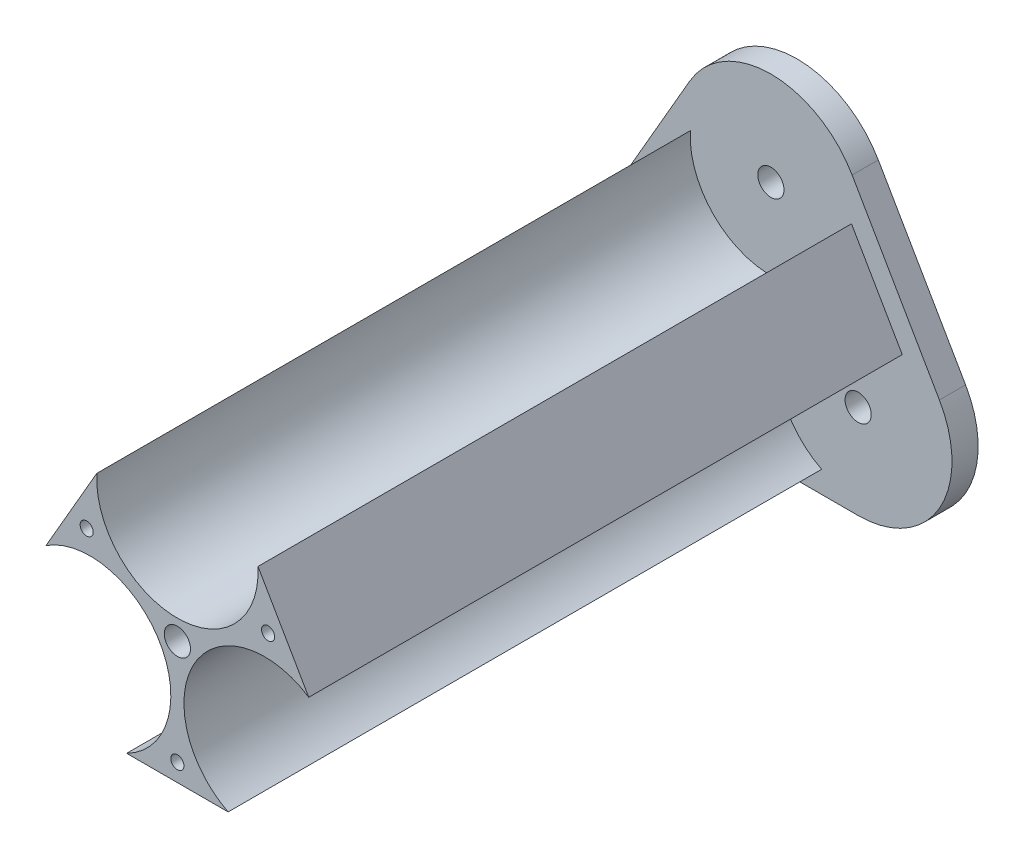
ISO-10303-21;
HEADER;
FILE_DESCRIPTION(('STEP AP214'),'2;1');
FILE_NAME('part.step','',(''),(''),'','','');
FILE_SCHEMA(('AUTOMOTIVE_DESIGN { 1 0 10303 214 1 1 1 1 }'));
ENDSEC;
DATA;
#1=APPLICATION_CONTEXT('core data for automotive mechanical design processes');
#2=APPLICATION_PROTOCOL_DEFINITION('international standard','automotive_design',2000,#1);
#3=PRODUCT_CONTEXT('',#1,'mechanical');
#4=PRODUCT('Part','Part','',(#3));
#5=PRODUCT_RELATED_PRODUCT_CATEGORY('part','',(#4));
#6=PRODUCT_DEFINITION_FORMATION('','',#4);
#7=PRODUCT_DEFINITION_CONTEXT('part definition',#1,'design');
#8=PRODUCT_DEFINITION('design','',#6,#7);
#9=PRODUCT_DEFINITION_SHAPE('','',#8);
#10=(LENGTH_UNIT() NAMED_UNIT(*) SI_UNIT(.MILLI.,.METRE.));
#11=(NAMED_UNIT(*) PLANE_ANGLE_UNIT() SI_UNIT($,.RADIAN.));
#12=(NAMED_UNIT(*) SI_UNIT($,.STERADIAN.) SOLID_ANGLE_UNIT());
#13=UNCERTAINTY_MEASURE_WITH_UNIT(LENGTH_MEASURE(1.E-05),#10,'distance_accuracy_value','');
#14=(GEOMETRIC_REPRESENTATION_CONTEXT(3) GLOBAL_UNCERTAINTY_ASSIGNED_CONTEXT((#13)) GLOBAL_UNIT_ASSIGNED_CONTEXT((#10,
#11,#12)) REPRESENTATION_CONTEXT('',''));
#15=CARTESIAN_POINT('',(0.,0.,0.));
#16=DIRECTION('',(0.,0.,1.));
#17=DIRECTION('',(1.,0.,0.));
#18=AXIS2_PLACEMENT_3D('',#15,#16,#17);
#19=CARTESIAN_POINT('',(-10.,10.75,3.));
#20=DIRECTION('',(0.,0.,-1.));
#21=DIRECTION('',(-1.,0.,0.));
#22=AXIS2_PLACEMENT_3D('',#19,#20,#21);
#23=CYLINDRICAL_SURFACE('',#22,10.75);
#24=CARTESIAN_POINT('',(-10.,10.75,0.));
#25=DIRECTION('',(0.,0.,1.));
#26=DIRECTION('',(-1.,0.,0.));
#27=AXIS2_PLACEMENT_3D('',#24,#25,#26);
#28=CIRCLE('',#27,10.75);
#29=CARTESIAN_POINT('',(-19.3097730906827,16.125,0.));
#30=VERTEX_POINT('',#29);
#31=CARTESIAN_POINT('',(-10.,0.,0.));
#32=VERTEX_POINT('',#31);
#33=EDGE_CURVE('E145',#30,#32,#28,.T.);
#34=ORIENTED_EDGE('',*,*,#33,.T.);
#35=DIRECTION('',(0.,0.,-1.));
#36=VECTOR('',#35,1.);
#37=CARTESIAN_POINT('',(-10.,0.,3.));
#38=LINE('',#37,#36);
#39=CARTESIAN_POINT('',(-10.,0.,3.));
#40=VERTEX_POINT('',#39);
#41=EDGE_CURVE('E11',#40,#32,#38,.T.);
#42=ORIENTED_EDGE('',*,*,#41,.F.);
#43=CARTESIAN_POINT('',(-10.,10.75,3.));
#44=DIRECTION('',(0.,0.,1.));
#45=DIRECTION('',(-1.,0.,0.));
#46=AXIS2_PLACEMENT_3D('',#43,#44,#45);
#47=CIRCLE('',#46,10.75);
#48=CARTESIAN_POINT('',(-19.3097730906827,16.125,3.));
#49=VERTEX_POINT('',#48);
#50=EDGE_CURVE('E154',#49,#40,#47,.T.);
#51=ORIENTED_EDGE('',*,*,#50,.F.);
#52=DIRECTION('',(0.,0.,-1.));
#53=VECTOR('',#52,1.);
#54=CARTESIAN_POINT('',(-19.3097730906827,16.125,3.));
#55=LINE('',#54,#53);
#56=EDGE_CURVE('E167',#49,#30,#55,.T.);
#57=ORIENTED_EDGE('',*,*,#56,.T.);
#58=EDGE_LOOP('',(#34,#42,#51,#57));
#59=FACE_BOUND('',#58,.T.);
#60=ADVANCED_FACE('F35',(#59),#23,.T.);
#61=CARTESIAN_POINT('',(-10.,0.,3.));
#62=DIRECTION('',(0.,1.,0.));
#63=DIRECTION('',(0.,0.,1.));
#64=AXIS2_PLACEMENT_3D('',#61,#62,#63);
#65=PLANE('',#64);
#66=DIRECTION('',(1.,0.,0.));
#67=VECTOR('',#66,1.);
#68=CARTESIAN_POINT('',(-10.,0.,0.));
#69=LINE('',#68,#67);
#70=CARTESIAN_POINT('',(10.,0.,0.));
#71=VERTEX_POINT('',#70);
#72=EDGE_CURVE('E148',#32,#71,#69,.T.);
#73=ORIENTED_EDGE('',*,*,#72,.T.);
#74=DIRECTION('',(0.,0.,-1.));
#75=VECTOR('',#74,1.);
#76=CARTESIAN_POINT('',(10.,0.,3.));
#77=LINE('',#76,#75);
#78=CARTESIAN_POINT('',(10.,0.,3.));
#79=VERTEX_POINT('',#78);
#80=EDGE_CURVE('E42',#79,#71,#77,.T.);
#81=ORIENTED_EDGE('',*,*,#80,.F.);
#82=DIRECTION('',(1.,0.,0.));
#83=VECTOR('',#82,1.);
#84=CARTESIAN_POINT('',(-10.,0.,3.));
#85=LINE('',#84,#83);
#86=EDGE_CURVE('E157',#40,#79,#85,.T.);
#87=ORIENTED_EDGE('',*,*,#86,.F.);
#88=ORIENTED_EDGE('',*,*,#41,.T.);
#89=EDGE_LOOP('',(#73,#81,#87,#88));
#90=FACE_BOUND('',#89,.T.);
#91=ADVANCED_FACE('F215',(#90),#65,.F.);
#92=CARTESIAN_POINT('',(10.,10.75,3.));
#93=DIRECTION('',(0.,0.,-1.));
#94=DIRECTION('',(-1.,0.,0.));
#95=AXIS2_PLACEMENT_3D('',#92,#93,#94);
#96=CYLINDRICAL_SURFACE('',#95,10.75);
#97=CARTESIAN_POINT('',(10.,10.75,0.));
#98=DIRECTION('',(0.,0.,1.));
#99=DIRECTION('',(1.,0.,0.));
#100=AXIS2_PLACEMENT_3D('',#97,#98,#99);
#101=CIRCLE('',#100,10.75);
#102=CARTESIAN_POINT('',(19.3097730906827,16.125,0.));
#103=VERTEX_POINT('',#102);
#104=EDGE_CURVE('E170',#71,#103,#101,.T.);
#105=ORIENTED_EDGE('',*,*,#104,.T.);
#106=DIRECTION('',(0.,0.,-1.));
#107=VECTOR('',#106,1.);
#108=CARTESIAN_POINT('',(19.3097730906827,16.125,3.));
#109=LINE('',#108,#107);
#110=CARTESIAN_POINT('',(19.3097730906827,16.125,3.));
#111=VERTEX_POINT('',#110);
#112=EDGE_CURVE('E185',#111,#103,#109,.T.);
#113=ORIENTED_EDGE('',*,*,#112,.F.);
#114=CARTESIAN_POINT('',(10.,10.75,3.));
#115=DIRECTION('',(0.,0.,1.));
#116=DIRECTION('',(1.,0.,0.));
#117=AXIS2_PLACEMENT_3D('',#114,#115,#116);
#118=CIRCLE('',#117,10.75);
#119=EDGE_CURVE('E160',#79,#111,#118,.T.);
#120=ORIENTED_EDGE('',*,*,#119,.F.);
#121=ORIENTED_EDGE('',*,*,#80,.T.);
#122=EDGE_LOOP('',(#105,#113,#120,#121));
#123=FACE_BOUND('',#122,.T.);
#124=ADVANCED_FACE('F192',(#123),#96,.T.);
#125=CARTESIAN_POINT('',(9.30977309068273,33.4455080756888,3.));
#126=DIRECTION('',(-0.866025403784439,-0.5,0.));
#127=DIRECTION('',(0.5,-0.866025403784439,0.));
#128=AXIS2_PLACEMENT_3D('',#125,#126,#127);
#129=PLANE('',#128);
#130=DIRECTION('',(-0.499999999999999,0.866025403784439,0.));
#131=VECTOR('',#130,1.);
#132=CARTESIAN_POINT('',(9.30977309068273,33.4455080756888,0.));
#133=LINE('',#132,#131);
#134=CARTESIAN_POINT('',(9.30977309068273,33.4455080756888,0.));
#135=VERTEX_POINT('',#134);
#136=EDGE_CURVE('E172',#103,#135,#133,.T.);
#137=ORIENTED_EDGE('',*,*,#136,.T.);
#138=DIRECTION('',(0.,0.,-1.));
#139=VECTOR('',#138,1.);
#140=CARTESIAN_POINT('',(9.30977309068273,33.4455080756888,3.));
#141=LINE('',#140,#139);
#142=CARTESIAN_POINT('',(9.30977309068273,33.4455080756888,3.));
#143=VERTEX_POINT('',#142);
#144=EDGE_CURVE('E182',#143,#135,#141,.T.);
#145=ORIENTED_EDGE('',*,*,#144,.F.);
#146=DIRECTION('',(-0.499999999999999,0.866025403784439,0.));
#147=VECTOR('',#146,1.);
#148=CARTESIAN_POINT('',(9.30977309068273,33.4455080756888,3.));
#149=LINE('',#148,#147);
#150=EDGE_CURVE('E162',#111,#143,#149,.T.);
#151=ORIENTED_EDGE('',*,*,#150,.F.);
#152=ORIENTED_EDGE('',*,*,#112,.T.);
#153=EDGE_LOOP('',(#137,#145,#151,#152));
#154=FACE_BOUND('',#153,.T.);
#155=ADVANCED_FACE('F203',(#154),#129,.F.);
#156=CARTESIAN_POINT('',(0.,28.0705080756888,3.));
#157=DIRECTION('',(0.,0.,-1.));
#158=DIRECTION('',(-1.,0.,0.));
#159=AXIS2_PLACEMENT_3D('',#156,#157,#158);
#160=CYLINDRICAL_SURFACE('',#159,10.75);
#161=CARTESIAN_POINT('',(0.,28.0705080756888,0.));
#162=DIRECTION('',(0.,0.,1.));
#163=DIRECTION('',(-1.,0.,0.));
#164=AXIS2_PLACEMENT_3D('',#161,#162,#163);
#165=CIRCLE('',#164,10.75);
#166=CARTESIAN_POINT('',(-9.30977309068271,33.4455080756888,0.));
#167=VERTEX_POINT('',#166);
#168=EDGE_CURVE('E174',#135,#167,#165,.T.);
#169=ORIENTED_EDGE('',*,*,#168,.T.);
#170=DIRECTION('',(0.,0.,-1.));
#171=VECTOR('',#170,1.);
#172=CARTESIAN_POINT('',(-9.30977309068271,33.4455080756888,3.));
#173=LINE('',#172,#171);
#174=CARTESIAN_POINT('',(-9.30977309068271,33.4455080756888,3.));
#175=VERTEX_POINT('',#174);
#176=EDGE_CURVE('E179',#175,#167,#173,.T.);
#177=ORIENTED_EDGE('',*,*,#176,.F.);
#178=CARTESIAN_POINT('',(0.,28.0705080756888,3.));
#179=DIRECTION('',(0.,0.,1.));
#180=DIRECTION('',(-1.,0.,0.));
#181=AXIS2_PLACEMENT_3D('',#178,#179,#180);
#182=CIRCLE('',#181,10.75);
#183=EDGE_CURVE('E164',#143,#175,#182,.T.);
#184=ORIENTED_EDGE('',*,*,#183,.F.);
#185=ORIENTED_EDGE('',*,*,#144,.T.);
#186=EDGE_LOOP('',(#169,#177,#184,#185));
#187=FACE_BOUND('',#186,.T.);
#188=ADVANCED_FACE('F207',(#187),#160,.T.);
#189=CARTESIAN_POINT('',(-9.30977309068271,33.4455080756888,3.));
#190=DIRECTION('',(0.866025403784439,-0.5,0.));
#191=DIRECTION('',(0.5,0.866025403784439,0.));
#192=AXIS2_PLACEMENT_3D('',#189,#190,#191);
#193=PLANE('',#192);
#194=DIRECTION('',(-0.5,-0.866025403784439,0.));
#195=VECTOR('',#194,1.);
#196=CARTESIAN_POINT('',(-9.30977309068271,33.4455080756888,0.));
#197=LINE('',#196,#195);
#198=EDGE_CURVE('E158',#167,#30,#197,.T.);
#199=ORIENTED_EDGE('',*,*,#198,.T.);
#200=ORIENTED_EDGE('',*,*,#56,.F.);
#201=DIRECTION('',(-0.5,-0.866025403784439,0.));
#202=VECTOR('',#201,1.);
#203=CARTESIAN_POINT('',(-9.30977309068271,33.4455080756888,3.));
#204=LINE('',#203,#202);
#205=EDGE_CURVE('E166',#175,#49,#204,.T.);
#206=ORIENTED_EDGE('',*,*,#205,.F.);
#207=ORIENTED_EDGE('',*,*,#176,.T.);
#208=EDGE_LOOP('',(#199,#200,#206,#207));
#209=FACE_BOUND('',#208,.T.);
#210=ADVANCED_FACE('F218',(#209),#193,.F.);
#211=CARTESIAN_POINT('',(-10.,10.75,3.));
#212=DIRECTION('',(0.,0.,-1.));
#213=DIRECTION('',(-1.,0.,0.));
#214=AXIS2_PLACEMENT_3D('',#211,#212,#213);
#215=PLANE('',#214);
#216=CARTESIAN_POINT('',(-10.,10.75,3.));
#217=DIRECTION('',(0.,0.,1.));
#218=DIRECTION('',(1.,0.,0.));
#219=AXIS2_PLACEMENT_3D('',#216,#217,#218);
#220=CIRCLE('',#219,1.5);
#221=CARTESIAN_POINT('',(-8.5,10.75,3.));
#222=VERTEX_POINT('',#221);
#223=EDGE_CURVE('E444',#222,#222,#220,.T.);
#224=ORIENTED_EDGE('',*,*,#223,.F.);
#225=EDGE_LOOP('',(#224));
#226=FACE_BOUND('',#225,.T.);
#227=CARTESIAN_POINT('',(10.,10.75,3.));
#228=DIRECTION('',(0.,0.,1.));
#229=DIRECTION('',(1.,0.,0.));
#230=AXIS2_PLACEMENT_3D('',#227,#228,#229);
#231=CIRCLE('',#230,1.5);
#232=CARTESIAN_POINT('',(11.5,10.75,3.));
#233=VERTEX_POINT('',#232);
#234=EDGE_CURVE('E451',#233,#233,#231,.T.);
#235=ORIENTED_EDGE('',*,*,#234,.F.);
#236=EDGE_LOOP('',(#235));
#237=FACE_BOUND('',#236,.T.);
#238=CARTESIAN_POINT('',(0.,28.0705080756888,3.));
#239=DIRECTION('',(0.,0.,1.));
#240=DIRECTION('',(1.,0.,0.));
#241=AXIS2_PLACEMENT_3D('',#238,#239,#240);
#242=CIRCLE('',#241,1.5);
#243=CARTESIAN_POINT('',(1.50000000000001,28.0705080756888,3.));
#244=VERTEX_POINT('',#243);
#245=EDGE_CURVE('E456',#244,#244,#242,.T.);
#246=ORIENTED_EDGE('',*,*,#245,.F.);
#247=EDGE_LOOP('',(#246));
#248=FACE_BOUND('',#247,.T.);
#249=CARTESIAN_POINT('',(-9.99999999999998,10.75,3.));
#250=DIRECTION('',(0.,0.,-1.));
#251=DIRECTION('',(1.,0.,0.));
#252=AXIS2_PLACEMENT_3D('',#249,#250,#251);
#253=CIRCLE('',#252,9.25);
#254=CARTESIAN_POINT('',(-15.0530595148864,18.4978441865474,3.));
#255=VERTEX_POINT('',#254);
#256=CARTESIAN_POINT('',(-5.81669986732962,2.5,3.));
#257=VERTEX_POINT('',#256);
#258=EDGE_CURVE('E144',#255,#257,#253,.T.);
#259=ORIENTED_EDGE('',*,*,#258,.F.);
#260=DIRECTION('',(-0.5,-0.866025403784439,0.));
#261=VECTOR('',#260,1.);
#262=CARTESIAN_POINT('',(-9.2363596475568,28.5726638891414,3.));
#263=LINE('',#262,#261);
#264=CARTESIAN_POINT('',(-9.23635964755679,28.5726638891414,3.));
#265=VERTEX_POINT('',#264);
#266=EDGE_CURVE('E141',#265,#255,#263,.T.);
#267=ORIENTED_EDGE('',*,*,#266,.F.);
#268=CARTESIAN_POINT('',(0.,28.0705080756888,3.));
#269=DIRECTION('',(0.,0.,-1.));
#270=DIRECTION('',(1.,0.,0.));
#271=AXIS2_PLACEMENT_3D('',#268,#269,#270);
#272=CIRCLE('',#271,9.25);
#273=CARTESIAN_POINT('',(9.23635964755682,28.5726638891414,3.));
#274=VERTEX_POINT('',#273);
#275=EDGE_CURVE('E496',#274,#265,#272,.T.);
#276=ORIENTED_EDGE('',*,*,#275,.F.);
#277=DIRECTION('',(-0.5,0.866025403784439,0.));
#278=VECTOR('',#277,1.);
#279=CARTESIAN_POINT('',(9.23635964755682,28.5726638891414,3.));
#280=LINE('',#279,#278);
#281=CARTESIAN_POINT('',(15.0530595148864,18.4978441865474,3.));
#282=VERTEX_POINT('',#281);
#283=EDGE_CURVE('E493',#282,#274,#280,.T.);
#284=ORIENTED_EDGE('',*,*,#283,.F.);
#285=CARTESIAN_POINT('',(10.,10.75,3.));
#286=DIRECTION('',(0.,0.,-1.));
#287=DIRECTION('',(1.,0.,0.));
#288=AXIS2_PLACEMENT_3D('',#285,#286,#287);
#289=CIRCLE('',#288,9.25);
#290=CARTESIAN_POINT('',(5.81669986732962,2.5,3.));
#291=VERTEX_POINT('',#290);
#292=EDGE_CURVE('E54',#291,#282,#289,.T.);
#293=ORIENTED_EDGE('',*,*,#292,.F.);
#294=DIRECTION('',(1.,0.,0.));
#295=VECTOR('',#294,1.);
#296=CARTESIAN_POINT('',(-5.81669986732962,2.5,3.));
#297=LINE('',#296,#295);
#298=EDGE_CURVE('E49',#257,#291,#297,.T.);
#299=ORIENTED_EDGE('',*,*,#298,.F.);
#300=EDGE_LOOP('',(#259,#267,#276,#284,#293,#299));
#301=FACE_BOUND('',#300,.T.);
#302=ORIENTED_EDGE('',*,*,#50,.T.);
#303=ORIENTED_EDGE('',*,*,#86,.T.);
#304=ORIENTED_EDGE('',*,*,#119,.T.);
#305=ORIENTED_EDGE('',*,*,#150,.T.);
#306=ORIENTED_EDGE('',*,*,#183,.T.);
#307=ORIENTED_EDGE('',*,*,#205,.T.);
#308=EDGE_LOOP('',(#302,#303,#304,#305,#306,#307));
#309=FACE_BOUND('',#308,.T.);
#310=ADVANCED_FACE('F211',(#226,#237,#248,#301,#309),#215,.F.);
#311=CARTESIAN_POINT('',(-10.,10.75,0.));
#312=DIRECTION('',(0.,0.,-1.));
#313=DIRECTION('',(-1.,0.,0.));
#314=AXIS2_PLACEMENT_3D('',#311,#312,#313);
#315=PLANE('',#314);
#316=CARTESIAN_POINT('',(0.,16.5235026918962,0.));
#317=DIRECTION('',(0.,0.,1.));
#318=DIRECTION('',(1.,0.,0.));
#319=AXIS2_PLACEMENT_3D('',#316,#317,#318);
#320=CIRCLE('',#319,1.5);
#321=CARTESIAN_POINT('',(1.5,16.5235026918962,0.));
#322=VERTEX_POINT('',#321);
#323=EDGE_CURVE('E443',#322,#322,#320,.T.);
#324=ORIENTED_EDGE('',*,*,#323,.T.);
#325=EDGE_LOOP('',(#324));
#326=FACE_BOUND('',#325,.T.);
#327=CARTESIAN_POINT('',(-10.,10.75,0.));
#328=DIRECTION('',(0.,0.,1.));
#329=DIRECTION('',(1.,0.,0.));
#330=AXIS2_PLACEMENT_3D('',#327,#328,#329);
#331=CIRCLE('',#330,1.5);
#332=CARTESIAN_POINT('',(-8.5,10.75,0.));
#333=VERTEX_POINT('',#332);
#334=EDGE_CURVE('E447',#333,#333,#331,.T.);
#335=ORIENTED_EDGE('',*,*,#334,.T.);
#336=EDGE_LOOP('',(#335));
#337=FACE_BOUND('',#336,.T.);
#338=CARTESIAN_POINT('',(10.,10.75,0.));
#339=DIRECTION('',(0.,0.,1.));
#340=DIRECTION('',(1.,0.,0.));
#341=AXIS2_PLACEMENT_3D('',#338,#339,#340);
#342=CIRCLE('',#341,1.5);
#343=CARTESIAN_POINT('',(11.5,10.75,0.));
#344=VERTEX_POINT('',#343);
#345=EDGE_CURVE('E453',#344,#344,#342,.T.);
#346=ORIENTED_EDGE('',*,*,#345,.T.);
#347=EDGE_LOOP('',(#346));
#348=FACE_BOUND('',#347,.T.);
#349=CARTESIAN_POINT('',(0.,28.0705080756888,0.));
#350=DIRECTION('',(0.,0.,1.));
#351=DIRECTION('',(1.,0.,0.));
#352=AXIS2_PLACEMENT_3D('',#349,#350,#351);
#353=CIRCLE('',#352,1.5);
#354=CARTESIAN_POINT('',(1.50000000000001,28.0705080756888,0.));
#355=VERTEX_POINT('',#354);
#356=EDGE_CURVE('E459',#355,#355,#353,.T.);
#357=ORIENTED_EDGE('',*,*,#356,.T.);
#358=EDGE_LOOP('',(#357));
#359=FACE_BOUND('',#358,.T.);
#360=ORIENTED_EDGE('',*,*,#33,.F.);
#361=ORIENTED_EDGE('',*,*,#198,.F.);
#362=ORIENTED_EDGE('',*,*,#168,.F.);
#363=ORIENTED_EDGE('',*,*,#136,.F.);
#364=ORIENTED_EDGE('',*,*,#104,.F.);
#365=ORIENTED_EDGE('',*,*,#72,.F.);
#366=EDGE_LOOP('',(#360,#361,#362,#363,#364,#365));
#367=FACE_BOUND('',#366,.T.);
#368=ADVANCED_FACE('F198',(#326,#337,#348,#359,#367),#315,.T.);
#369=CARTESIAN_POINT('',(-9.99999999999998,10.75,71.));
#370=DIRECTION('',(0.,0.,1.));
#371=DIRECTION('',(1.,0.,0.));
#372=AXIS2_PLACEMENT_3D('',#369,#370,#371);
#373=PLANE('',#372);
#374=CARTESIAN_POINT('',(-10.3923048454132,22.5235026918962,71.));
#375=DIRECTION('',(0.,0.,1.));
#376=DIRECTION('',(1.,0.,0.));
#377=AXIS2_PLACEMENT_3D('',#374,#375,#376);
#378=CIRCLE('',#377,0.750000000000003);
#379=CARTESIAN_POINT('',(-9.64230484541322,22.5235026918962,71.));
#380=VERTEX_POINT('',#379);
#381=EDGE_CURVE('E462',#380,#380,#378,.T.);
#382=ORIENTED_EDGE('',*,*,#381,.F.);
#383=EDGE_LOOP('',(#382));
#384=FACE_BOUND('',#383,.T.);
#385=CARTESIAN_POINT('',(0.,4.52350269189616,71.));
#386=DIRECTION('',(0.,0.,1.));
#387=DIRECTION('',(1.,0.,0.));
#388=AXIS2_PLACEMENT_3D('',#385,#386,#387);
#389=CIRCLE('',#388,0.75);
#390=CARTESIAN_POINT('',(0.750000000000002,4.52350269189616,71.));
#391=VERTEX_POINT('',#390);
#392=EDGE_CURVE('E468',#391,#391,#389,.T.);
#393=ORIENTED_EDGE('',*,*,#392,.F.);
#394=EDGE_LOOP('',(#393));
#395=FACE_BOUND('',#394,.T.);
#396=CARTESIAN_POINT('',(10.3923048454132,22.5235026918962,71.));
#397=DIRECTION('',(0.,0.,1.));
#398=DIRECTION('',(1.,0.,0.));
#399=AXIS2_PLACEMENT_3D('',#396,#397,#398);
#400=CIRCLE('',#399,0.75);
#401=CARTESIAN_POINT('',(11.1423048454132,22.5235026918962,71.));
#402=VERTEX_POINT('',#401);
#403=EDGE_CURVE('E474',#402,#402,#400,.T.);
#404=ORIENTED_EDGE('',*,*,#403,.F.);
#405=EDGE_LOOP('',(#404));
#406=FACE_BOUND('',#405,.T.);
#407=CARTESIAN_POINT('',(-9.99999999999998,10.75,71.));
#408=DIRECTION('',(0.,0.,-1.));
#409=DIRECTION('',(1.,0.,0.));
#410=AXIS2_PLACEMENT_3D('',#407,#408,#409);
#411=CIRCLE('',#410,9.25);
#412=CARTESIAN_POINT('',(-15.0530595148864,18.4978441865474,71.));
#413=VERTEX_POINT('',#412);
#414=CARTESIAN_POINT('',(-5.81669986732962,2.5,71.));
#415=VERTEX_POINT('',#414);
#416=EDGE_CURVE('E131',#413,#415,#411,.T.);
#417=ORIENTED_EDGE('',*,*,#416,.T.);
#418=DIRECTION('',(1.,0.,0.));
#419=VECTOR('',#418,1.);
#420=CARTESIAN_POINT('',(-5.81669986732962,2.5,71.));
#421=LINE('',#420,#419);
#422=CARTESIAN_POINT('',(5.81669986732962,2.5,71.));
#423=VERTEX_POINT('',#422);
#424=EDGE_CURVE('E120',#415,#423,#421,.T.);
#425=ORIENTED_EDGE('',*,*,#424,.T.);
#426=CARTESIAN_POINT('',(10.,10.75,71.));
#427=DIRECTION('',(0.,0.,-1.));
#428=DIRECTION('',(1.,0.,0.));
#429=AXIS2_PLACEMENT_3D('',#426,#427,#428);
#430=CIRCLE('',#429,9.25);
#431=CARTESIAN_POINT('',(15.0530595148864,18.4978441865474,71.));
#432=VERTEX_POINT('',#431);
#433=EDGE_CURVE('E130',#423,#432,#430,.T.);
#434=ORIENTED_EDGE('',*,*,#433,.T.);
#435=DIRECTION('',(-0.5,0.866025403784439,0.));
#436=VECTOR('',#435,1.);
#437=CARTESIAN_POINT('',(9.23635964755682,28.5726638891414,71.));
#438=LINE('',#437,#436);
#439=CARTESIAN_POINT('',(9.23635964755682,28.5726638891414,71.));
#440=VERTEX_POINT('',#439);
#441=EDGE_CURVE('E484',#432,#440,#438,.T.);
#442=ORIENTED_EDGE('',*,*,#441,.T.);
#443=CARTESIAN_POINT('',(0.,28.0705080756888,71.));
#444=DIRECTION('',(0.,0.,-1.));
#445=DIRECTION('',(1.,0.,0.));
#446=AXIS2_PLACEMENT_3D('',#443,#444,#445);
#447=CIRCLE('',#446,9.25);
#448=CARTESIAN_POINT('',(-9.2363596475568,28.5726638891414,71.));
#449=VERTEX_POINT('',#448);
#450=EDGE_CURVE('E486',#440,#449,#447,.T.);
#451=ORIENTED_EDGE('',*,*,#450,.T.);
#452=DIRECTION('',(-0.5,-0.866025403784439,0.));
#453=VECTOR('',#452,1.);
#454=CARTESIAN_POINT('',(-9.2363596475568,28.5726638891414,71.));
#455=LINE('',#454,#453);
#456=EDGE_CURVE('E137',#449,#413,#455,.T.);
#457=ORIENTED_EDGE('',*,*,#456,.T.);
#458=EDGE_LOOP('',(#417,#425,#434,#442,#451,#457));
#459=FACE_BOUND('',#458,.T.);
#460=CARTESIAN_POINT('',(0.,16.5235026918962,71.));
#461=DIRECTION('',(0.,0.,1.));
#462=DIRECTION('',(1.,0.,0.));
#463=AXIS2_PLACEMENT_3D('',#460,#461,#462);
#464=CIRCLE('',#463,1.5);
#465=CARTESIAN_POINT('',(1.5,16.5235026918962,71.));
#466=VERTEX_POINT('',#465);
#467=EDGE_CURVE('E440',#466,#466,#464,.T.);
#468=ORIENTED_EDGE('',*,*,#467,.F.);
#469=EDGE_LOOP('',(#468));
#470=FACE_BOUND('',#469,.T.);
#471=ADVANCED_FACE('F134',(#384,#395,#406,#459,#470),#373,.T.);
#472=CARTESIAN_POINT('',(-9.99999999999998,10.75,71.));
#473=DIRECTION('',(0.,0.,-1.));
#474=DIRECTION('',(-1.,0.,0.));
#475=AXIS2_PLACEMENT_3D('',#472,#473,#474);
#476=CYLINDRICAL_SURFACE('',#475,9.25);
#477=ORIENTED_EDGE('',*,*,#258,.T.);
#478=DIRECTION('',(0.,0.,-1.));
#479=VECTOR('',#478,1.);
#480=CARTESIAN_POINT('',(-5.81669986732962,2.5,71.));
#481=LINE('',#480,#479);
#482=EDGE_CURVE('E124',#415,#257,#481,.T.);
#483=ORIENTED_EDGE('',*,*,#482,.F.);
#484=ORIENTED_EDGE('',*,*,#416,.F.);
#485=DIRECTION('',(0.,0.,-1.));
#486=VECTOR('',#485,1.);
#487=CARTESIAN_POINT('',(-15.0530595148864,18.4978441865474,71.));
#488=LINE('',#487,#486);
#489=EDGE_CURVE('E489',#413,#255,#488,.T.);
#490=ORIENTED_EDGE('',*,*,#489,.T.);
#491=EDGE_LOOP('',(#477,#483,#484,#490));
#492=FACE_BOUND('',#491,.T.);
#493=ADVANCED_FACE('F143',(#492),#476,.F.);
#494=CARTESIAN_POINT('',(-5.81669986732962,2.5,71.));
#495=DIRECTION('',(0.,1.,0.));
#496=DIRECTION('',(0.,0.,1.));
#497=AXIS2_PLACEMENT_3D('',#494,#495,#496);
#498=PLANE('',#497);
#499=ORIENTED_EDGE('',*,*,#298,.T.);
#500=DIRECTION('',(0.,0.,-1.));
#501=VECTOR('',#500,1.);
#502=CARTESIAN_POINT('',(5.81669986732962,2.5,71.));
#503=LINE('',#502,#501);
#504=EDGE_CURVE('E127',#423,#291,#503,.T.);
#505=ORIENTED_EDGE('',*,*,#504,.F.);
#506=ORIENTED_EDGE('',*,*,#424,.F.);
#507=ORIENTED_EDGE('',*,*,#482,.T.);
#508=EDGE_LOOP('',(#499,#505,#506,#507));
#509=FACE_BOUND('',#508,.T.);
#510=ADVANCED_FACE('F122',(#509),#498,.F.);
#511=CARTESIAN_POINT('',(10.,10.75,71.));
#512=DIRECTION('',(0.,0.,-1.));
#513=DIRECTION('',(-1.,0.,0.));
#514=AXIS2_PLACEMENT_3D('',#511,#512,#513);
#515=CYLINDRICAL_SURFACE('',#514,9.25);
#516=ORIENTED_EDGE('',*,*,#292,.T.);
#517=DIRECTION('',(0.,0.,-1.));
#518=VECTOR('',#517,1.);
#519=CARTESIAN_POINT('',(15.0530595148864,18.4978441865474,71.));
#520=LINE('',#519,#518);
#521=EDGE_CURVE('E150',#432,#282,#520,.T.);
#522=ORIENTED_EDGE('',*,*,#521,.F.);
#523=ORIENTED_EDGE('',*,*,#433,.F.);
#524=ORIENTED_EDGE('',*,*,#504,.T.);
#525=EDGE_LOOP('',(#516,#522,#523,#524));
#526=FACE_BOUND('',#525,.T.);
#527=ADVANCED_FACE('F271',(#526),#515,.F.);
#528=CARTESIAN_POINT('',(9.23635964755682,28.5726638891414,71.));
#529=DIRECTION('',(-0.866025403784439,-0.5,0.));
#530=DIRECTION('',(0.5,-0.866025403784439,0.));
#531=AXIS2_PLACEMENT_3D('',#528,#529,#530);
#532=PLANE('',#531);
#533=ORIENTED_EDGE('',*,*,#283,.T.);
#534=DIRECTION('',(0.,0.,-1.));
#535=VECTOR('',#534,1.);
#536=CARTESIAN_POINT('',(9.23635964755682,28.5726638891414,71.));
#537=LINE('',#536,#535);
#538=EDGE_CURVE('E505',#440,#274,#537,.T.);
#539=ORIENTED_EDGE('',*,*,#538,.F.);
#540=ORIENTED_EDGE('',*,*,#441,.F.);
#541=ORIENTED_EDGE('',*,*,#521,.T.);
#542=EDGE_LOOP('',(#533,#539,#540,#541));
#543=FACE_BOUND('',#542,.T.);
#544=ADVANCED_FACE('F280',(#543),#532,.F.);
#545=CARTESIAN_POINT('',(0.,28.0705080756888,71.));
#546=DIRECTION('',(0.,0.,-1.));
#547=DIRECTION('',(-1.,0.,0.));
#548=AXIS2_PLACEMENT_3D('',#545,#546,#547);
#549=CYLINDRICAL_SURFACE('',#548,9.25);
#550=ORIENTED_EDGE('',*,*,#275,.T.);
#551=DIRECTION('',(0.,0.,-1.));
#552=VECTOR('',#551,1.);
#553=CARTESIAN_POINT('',(-9.2363596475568,28.5726638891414,71.));
#554=LINE('',#553,#552);
#555=EDGE_CURVE('E502',#449,#265,#554,.T.);
#556=ORIENTED_EDGE('',*,*,#555,.F.);
#557=ORIENTED_EDGE('',*,*,#450,.F.);
#558=ORIENTED_EDGE('',*,*,#538,.T.);
#559=EDGE_LOOP('',(#550,#556,#557,#558));
#560=FACE_BOUND('',#559,.T.);
#561=ADVANCED_FACE('F290',(#560),#549,.F.);
#562=CARTESIAN_POINT('',(-9.2363596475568,28.5726638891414,71.));
#563=DIRECTION('',(0.866025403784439,-0.5,0.));
#564=DIRECTION('',(0.5,0.866025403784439,0.));
#565=AXIS2_PLACEMENT_3D('',#562,#563,#564);
#566=PLANE('',#565);
#567=ORIENTED_EDGE('',*,*,#266,.T.);
#568=ORIENTED_EDGE('',*,*,#489,.F.);
#569=ORIENTED_EDGE('',*,*,#456,.F.);
#570=ORIENTED_EDGE('',*,*,#555,.T.);
#571=EDGE_LOOP('',(#567,#568,#569,#570));
#572=FACE_BOUND('',#571,.T.);
#573=ADVANCED_FACE('F300',(#572),#566,.F.);
#574=CARTESIAN_POINT('',(0.,16.5235026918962,71.));
#575=DIRECTION('',(0.,0.,-1.));
#576=DIRECTION('',(-1.,0.,0.));
#577=AXIS2_PLACEMENT_3D('',#574,#575,#576);
#578=CYLINDRICAL_SURFACE('',#577,1.5);
#579=ORIENTED_EDGE('',*,*,#467,.T.);
#580=EDGE_LOOP('',(#579));
#581=FACE_BOUND('',#580,.T.);
#582=ORIENTED_EDGE('',*,*,#323,.F.);
#583=EDGE_LOOP('',(#582));
#584=FACE_BOUND('',#583,.T.);
#585=ADVANCED_FACE('F310',(#581,#584),#578,.F.);
#586=CARTESIAN_POINT('',(10.3923048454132,22.5235026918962,56.));
#587=DIRECTION('',(0.,0.,1.));
#588=DIRECTION('',(1.,0.,0.));
#589=AXIS2_PLACEMENT_3D('',#586,#587,#588);
#590=CYLINDRICAL_SURFACE('',#589,0.75);
#591=CARTESIAN_POINT('',(10.3923048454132,22.5235026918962,56.));
#592=DIRECTION('',(0.,0.,1.));
#593=DIRECTION('',(1.,0.,0.));
#594=AXIS2_PLACEMENT_3D('',#591,#592,#593);
#595=CIRCLE('',#594,0.75);
#596=CARTESIAN_POINT('',(11.1423048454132,22.5235026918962,56.));
#597=VERTEX_POINT('',#596);
#598=EDGE_CURVE('E477',#597,#597,#595,.T.);
#599=ORIENTED_EDGE('',*,*,#598,.F.);
#600=EDGE_LOOP('',(#599));
#601=FACE_BOUND('',#600,.T.);
#602=ORIENTED_EDGE('',*,*,#403,.T.);
#603=EDGE_LOOP('',(#602));
#604=FACE_BOUND('',#603,.T.);
#605=ADVANCED_FACE('F327',(#601,#604),#590,.F.);
#606=CARTESIAN_POINT('',(10.3923048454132,22.5235026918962,56.));
#607=DIRECTION('',(0.,0.,1.));
#608=DIRECTION('',(1.,0.,0.));
#609=AXIS2_PLACEMENT_3D('',#606,#607,#608);
#610=PLANE('',#609);
#611=ORIENTED_EDGE('',*,*,#598,.T.);
#612=EDGE_LOOP('',(#611));
#613=FACE_BOUND('',#612,.T.);
#614=ADVANCED_FACE('F332',(#613),#610,.T.);
#615=CARTESIAN_POINT('',(0.,4.52350269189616,56.));
#616=DIRECTION('',(0.,0.,1.));
#617=DIRECTION('',(1.,0.,0.));
#618=AXIS2_PLACEMENT_3D('',#615,#616,#617);
#619=CYLINDRICAL_SURFACE('',#618,0.75);
#620=CARTESIAN_POINT('',(0.,4.52350269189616,56.));
#621=DIRECTION('',(0.,0.,1.));
#622=DIRECTION('',(1.,0.,0.));
#623=AXIS2_PLACEMENT_3D('',#620,#621,#622);
#624=CIRCLE('',#623,0.75);
#625=CARTESIAN_POINT('',(0.750000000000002,4.52350269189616,56.));
#626=VERTEX_POINT('',#625);
#627=EDGE_CURVE('E471',#626,#626,#624,.T.);
#628=ORIENTED_EDGE('',*,*,#627,.F.);
#629=EDGE_LOOP('',(#628));
#630=FACE_BOUND('',#629,.T.);
#631=ORIENTED_EDGE('',*,*,#392,.T.);
#632=EDGE_LOOP('',(#631));
#633=FACE_BOUND('',#632,.T.);
#634=ADVANCED_FACE('F342',(#630,#633),#619,.F.);
#635=CARTESIAN_POINT('',(0.,4.52350269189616,56.));
#636=DIRECTION('',(0.,0.,1.));
#637=DIRECTION('',(1.,0.,0.));
#638=AXIS2_PLACEMENT_3D('',#635,#636,#637);
#639=PLANE('',#638);
#640=ORIENTED_EDGE('',*,*,#627,.T.);
#641=EDGE_LOOP('',(#640));
#642=FACE_BOUND('',#641,.T.);
#643=ADVANCED_FACE('F352',(#642),#639,.T.);
#644=CARTESIAN_POINT('',(-10.3923048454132,22.5235026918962,56.));
#645=DIRECTION('',(0.,0.,1.));
#646=DIRECTION('',(1.,0.,0.));
#647=AXIS2_PLACEMENT_3D('',#644,#645,#646);
#648=CYLINDRICAL_SURFACE('',#647,0.750000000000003);
#649=CARTESIAN_POINT('',(-10.3923048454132,22.5235026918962,56.));
#650=DIRECTION('',(0.,0.,1.));
#651=DIRECTION('',(1.,0.,0.));
#652=AXIS2_PLACEMENT_3D('',#649,#650,#651);
#653=CIRCLE('',#652,0.750000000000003);
#654=CARTESIAN_POINT('',(-9.64230484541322,22.5235026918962,56.));
#655=VERTEX_POINT('',#654);
#656=EDGE_CURVE('E465',#655,#655,#653,.T.);
#657=ORIENTED_EDGE('',*,*,#656,.F.);
#658=EDGE_LOOP('',(#657));
#659=FACE_BOUND('',#658,.T.);
#660=ORIENTED_EDGE('',*,*,#381,.T.);
#661=EDGE_LOOP('',(#660));
#662=FACE_BOUND('',#661,.T.);
#663=ADVANCED_FACE('F362',(#659,#662),#648,.F.);
#664=CARTESIAN_POINT('',(-10.3923048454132,22.5235026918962,56.));
#665=DIRECTION('',(0.,0.,1.));
#666=DIRECTION('',(1.,0.,0.));
#667=AXIS2_PLACEMENT_3D('',#664,#665,#666);
#668=PLANE('',#667);
#669=ORIENTED_EDGE('',*,*,#656,.T.);
#670=EDGE_LOOP('',(#669));
#671=FACE_BOUND('',#670,.T.);
#672=ADVANCED_FACE('F372',(#671),#668,.T.);
#673=CARTESIAN_POINT('',(0.,28.0705080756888,0.));
#674=DIRECTION('',(0.,0.,1.));
#675=DIRECTION('',(1.,0.,0.));
#676=AXIS2_PLACEMENT_3D('',#673,#674,#675);
#677=CYLINDRICAL_SURFACE('',#676,1.5);
#678=ORIENTED_EDGE('',*,*,#356,.F.);
#679=EDGE_LOOP('',(#678));
#680=FACE_BOUND('',#679,.T.);
#681=ORIENTED_EDGE('',*,*,#245,.T.);
#682=EDGE_LOOP('',(#681));
#683=FACE_BOUND('',#682,.T.);
#684=ADVANCED_FACE('F382',(#680,#683),#677,.F.);
#685=CARTESIAN_POINT('',(10.,10.75,0.));
#686=DIRECTION('',(0.,0.,1.));
#687=DIRECTION('',(1.,0.,0.));
#688=AXIS2_PLACEMENT_3D('',#685,#686,#687);
#689=CYLINDRICAL_SURFACE('',#688,1.5);
#690=ORIENTED_EDGE('',*,*,#345,.F.);
#691=EDGE_LOOP('',(#690));
#692=FACE_BOUND('',#691,.T.);
#693=ORIENTED_EDGE('',*,*,#234,.T.);
#694=EDGE_LOOP('',(#693));
#695=FACE_BOUND('',#694,.T.);
#696=ADVANCED_FACE('F397',(#692,#695),#689,.F.);
#697=CARTESIAN_POINT('',(-10.,10.75,0.));
#698=DIRECTION('',(0.,0.,1.));
#699=DIRECTION('',(1.,0.,0.));
#700=AXIS2_PLACEMENT_3D('',#697,#698,#699);
#701=CYLINDRICAL_SURFACE('',#700,1.5);
#702=ORIENTED_EDGE('',*,*,#334,.F.);
#703=EDGE_LOOP('',(#702));
#704=FACE_BOUND('',#703,.T.);
#705=ORIENTED_EDGE('',*,*,#223,.T.);
#706=EDGE_LOOP('',(#705));
#707=FACE_BOUND('',#706,.T.);
#708=ADVANCED_FACE('F407',(#704,#707),#701,.F.);
#709=CLOSED_SHELL('',(#60,#91,#124,#155,#188,#210,#310,#368,#471,#493,#510,#527,#544,#561,#573,
#585,#605,#614,#634,#643,#663,#672,#684,#696,#708));
#710=MANIFOLD_SOLID_BREP('B2',#709);
#711=ADVANCED_BREP_SHAPE_REPRESENTATION('',(#18,#710),#14);
#712=SHAPE_DEFINITION_REPRESENTATION(#9,#711);
ENDSEC;
END-ISO-10303-21;
